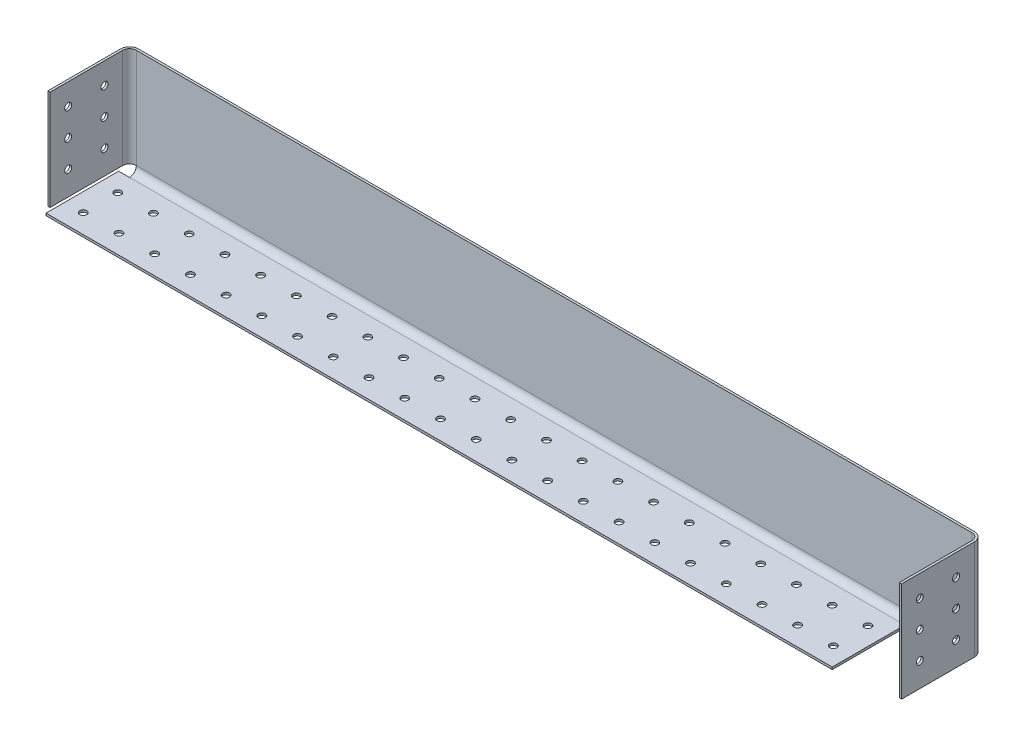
from build123d import *

# Parameters (mm, degrees)
BOSS_EXTRUDE5_DEPTH      = 633.7427
BOSS_EXTRUDE5_DEPTH_BACK = 534.6573
BOSS_EXTRUDE6_DEPTH      = 139.7
SKETCH9_W                = 94.579641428
SKETCH9_H                = 126.783360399
CUT_EXTRUDE3_DEPTH       = 12.7
SKETCH10_W               = 15.15606951
SKETCH10_H               = 101.6
BOSS_EXTRUDE7_DEPTH      = 3.175
SKETCH8_R                = 4.9022
CUT_EXTRUDE4_DEPTH       = 3.175
CUT_EXTRUDE5_DEPTH       = 668.192756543
CUT_EXTRUDE5_DEPTH_BACK  = 668.192756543
SKETCH11_R               = 4.9022


with BuildPart() as part:
    # side 1 prof → Boss-Extrude5 (new, two sides: drawn at the far end of the back side and taken through both)
    with BuildSketch(Plane(origin=(0, 0, 0), x_dir=(0, 0, -1), z_dir=(1, 0, 0)).offset(-BOSS_EXTRUDE5_DEPTH_BACK)):
        with BuildLine():
            Line((-50.8, 3.175), (50.8, 3.175))
            ThreePointArc((50.8, 3.175), (57.535192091, 5.964807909), (60.325, 12.7))
            Line((60.325, 12.7), (60.325, 152.4))
            Line((60.325, 152.4), (63.5, 152.4))
            Line((63.5, 152.4), (63.5, 12.7))
            ThreePointArc((63.5, 12.7), (59.780256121, 3.719743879), (50.8, 0))
            Line((50.8, 0), (-50.8, 0))
            Line((-50.8, 0), (-50.8, 3.175))
        make_face()
    extrude(amount=BOSS_EXTRUDE5_DEPTH + BOSS_EXTRUDE5_DEPTH_BACK)

    # Sketch4 → Boss-Extrude6 (add)
    with BuildSketch(Plane(origin=(0, 12.7, 0), x_dir=(1, 0, 0), z_dir=(0, 1, 0))):
        with BuildLine():
            Line((-547.3573, -50.8), (-547.3573, 50.8))
            ThreePointArc((-547.3573, 50.8), (-543.637556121, 59.780256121), (-534.6573, 63.5))
            Line((-534.6573, 63.5), (633.7427, 63.5))
            ThreePointArc((633.7427, 63.5), (642.722956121, 59.780256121), (646.4427, 50.8))
            Line((646.4427, 50.8), (646.4427, -50.8))
            Line((646.4427, -50.8), (643.2677, -50.8))
            Line((643.2677, -50.8), (643.2677, 50.8))
            ThreePointArc((643.2677, 50.8), (640.477892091, 57.535192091), (633.7427, 60.325))
            Line((633.7427, 60.325), (-534.6573, 60.325))
            ThreePointArc((-534.6573, 60.325), (-541.392492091, 57.535192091), (-544.1823, 50.8))
            Line((-544.1823, 50.8), (-544.1823, -50.8))
            Line((-544.1823, -50.8), (-547.3573, -50.8))
        make_face()
    extrude(amount=BOSS_EXTRUDE6_DEPTH)

    # Sketch9 → Cut-Extrude3 (cut)
    with BuildSketch(Plane(origin=(0, 0, 0), x_dir=(1, 0, 0), z_dir=(0, 1, 0))):
        with Locations((596.723570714, 6.081657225)):
            Rectangle(SKETCH9_W, SKETCH9_H)
    extrude(amount=CUT_EXTRUDE3_DEPTH, mode=Mode.SUBTRACT)

    # Sketch10 → Boss-Extrude7 (add)
    with BuildSketch(Plane(origin=(0, 0, 0), x_dir=(1, 0, 0), z_dir=(0, 1, 0))):
        with Locations((-542.235334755, 0)):
            Rectangle(SKETCH10_W, SKETCH10_H)
    extrude(amount=BOSS_EXTRUDE7_DEPTH)

    # Sketch8 → Cut-Extrude4 (cut)
    with BuildSketch(Plane(origin=(0, 0, 0), x_dir=(1, 0, 0), z_dir=(0, 1, 0))):
        with Locations((-574.3575, 24.13)):
            Circle(SKETCH8_R)
        with Locations((-574.3575, -24.13)):
            Circle(SKETCH8_R)
        with Locations(Location((-524.413369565, 24.13, 0), (0, 0, 270))):
            Circle(SKETCH8_R)
        with Locations(Location((-524.413369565, -24.13, 0), (0, 0, 270))):
            Circle(SKETCH8_R)
        with Locations(Location((-474.46923913, 24.13, 0), (0, 0, 270))):
            Circle(SKETCH8_R)
        with Locations(Location((-474.46923913, -24.13, 0), (0, 0, 270))):
            Circle(SKETCH8_R)
        with Locations(Location((-424.525108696, 24.13, 0), (0, 0, 270))):
            Circle(SKETCH8_R)
        with Locations(Location((-424.525108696, -24.13, 0), (0, 0, 270))):
            Circle(SKETCH8_R)
        with Locations(Location((-374.580978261, 24.13, 0), (0, 0, 270))):
            Circle(SKETCH8_R)
        with Locations(Location((-374.580978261, -24.13, 0), (0, 0, 270))):
            Circle(SKETCH8_R)
        with Locations(Location((-324.636847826, 24.13, 0), (0, 0, 270))):
            Circle(SKETCH8_R)
        with Locations(Location((-324.636847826, -24.13, 0), (0, 0, 270))):
            Circle(SKETCH8_R)
        with Locations(Location((-274.692717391, 24.13, 0), (0, 0, 270))):
            Circle(SKETCH8_R)
        with Locations(Location((-274.692717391, -24.13, 0), (0, 0, 270))):
            Circle(SKETCH8_R)
        with Locations(Location((-224.748586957, 24.13, 0), (0, 0, 270))):
            Circle(SKETCH8_R)
        with Locations(Location((-224.748586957, -24.13, 0), (0, 0, 270))):
            Circle(SKETCH8_R)
        with Locations(Location((-174.804456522, 24.13, 0), (0, 0, 270))):
            Circle(SKETCH8_R)
        with Locations(Location((-174.804456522, -24.13, 0), (0, 0, 270))):
            Circle(SKETCH8_R)
        with Locations(Location((-124.860326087, 24.13, 0), (0, 0, 270))):
            Circle(SKETCH8_R)
        with Locations(Location((-124.860326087, -24.13, 0), (0, 0, 270))):
            Circle(SKETCH8_R)
        with Locations(Location((-74.916195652, 24.13, 0), (0, 0, 270))):
            Circle(SKETCH8_R)
        with Locations(Location((-74.916195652, -24.13, 0), (0, 0, 270))):
            Circle(SKETCH8_R)
        with Locations(Location((-24.972065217, 24.13, 0), (0, 0, 270))):
            Circle(SKETCH8_R)
        with Locations(Location((-24.972065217, -24.13, 0), (0, 0, 270))):
            Circle(SKETCH8_R)
        with Locations(Location((24.972065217, 24.13, 0), (0, 0, 270))):
            Circle(SKETCH8_R)
        with Locations(Location((24.972065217, -24.13, 0), (0, 0, 270))):
            Circle(SKETCH8_R)
        with Locations(Location((74.916195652, 24.13, 0), (0, 0, 270))):
            Circle(SKETCH8_R)
        with Locations(Location((74.916195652, -24.13, 0), (0, 0, 270))):
            Circle(SKETCH8_R)
        with Locations(Location((124.860326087, 24.13, 0), (0, 0, 270))):
            Circle(SKETCH8_R)
        with Locations(Location((124.860326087, -24.13, 0), (0, 0, 270))):
            Circle(SKETCH8_R)
        with Locations(Location((174.804456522, 24.13, 0), (0, 0, 270))):
            Circle(SKETCH8_R)
        with Locations(Location((174.804456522, -24.13, 0), (0, 0, 270))):
            Circle(SKETCH8_R)
        with Locations(Location((224.748586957, 24.13, 0), (0, 0, 270))):
            Circle(SKETCH8_R)
        with Locations(Location((224.748586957, -24.13, 0), (0, 0, 270))):
            Circle(SKETCH8_R)
        with Locations(Location((274.692717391, 24.13, 0), (0, 0, 270))):
            Circle(SKETCH8_R)
        with Locations(Location((274.692717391, -24.13, 0), (0, 0, 270))):
            Circle(SKETCH8_R)
        with Locations(Location((324.636847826, 24.13, 0), (0, 0, 270))):
            Circle(SKETCH8_R)
        with Locations(Location((324.636847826, -24.13, 0), (0, 0, 270))):
            Circle(SKETCH8_R)
        with Locations(Location((374.580978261, 24.13, 0), (0, 0, 270))):
            Circle(SKETCH8_R)
        with Locations(Location((374.580978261, -24.13, 0), (0, 0, 270))):
            Circle(SKETCH8_R)
        with Locations(Location((424.525108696, 24.13, 0), (0, 0, 270))):
            Circle(SKETCH8_R)
        with Locations(Location((424.525108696, -24.13, 0), (0, 0, 270))):
            Circle(SKETCH8_R)
        with Locations(Location((474.46923913, 24.13, 0), (0, 0, 270))):
            Circle(SKETCH8_R)
        with Locations(Location((474.46923913, -24.13, 0), (0, 0, 270))):
            Circle(SKETCH8_R)
        with Locations(Location((524.413369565, 24.13, 0), (0, 0, 270))):
            Circle(SKETCH8_R)
        with Locations(Location((524.413369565, -24.13, 0), (0, 0, 270))):
            Circle(SKETCH8_R)
        with Locations((574.3575, 24.13)):
            Circle(SKETCH8_R)
        with Locations((574.3575, -24.13)):
            Circle(SKETCH8_R)
    extrude(amount=CUT_EXTRUDE4_DEPTH, mode=Mode.SUBTRACT)

    # Sketch11 → Cut-Extrude5 (cut, two sides: drawn at the far end of the back side and taken through both)
    with BuildSketch(Plane(origin=(0, 0, 0), x_dir=(0, 0, -1), z_dir=(1, 0, 0)).offset(-CUT_EXTRUDE5_DEPTH_BACK)):
        with Locations((-25.4, 46.355)):
            Circle(SKETCH11_R)
        with Locations((25.4, 46.355)):
            Circle(SKETCH11_R)
        with Locations((-25.4, 84.254473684)):
            Circle(SKETCH11_R)
        with Locations((25.4, 84.254473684)):
            Circle(SKETCH11_R)
        with Locations((-25.4, 122.153947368)):
            Circle(SKETCH11_R)
        with Locations((25.4, 122.153947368)):
            Circle(SKETCH11_R)
    extrude(amount=CUT_EXTRUDE5_DEPTH + CUT_EXTRUDE5_DEPTH_BACK, mode=Mode.SUBTRACT)


solid = part.part
